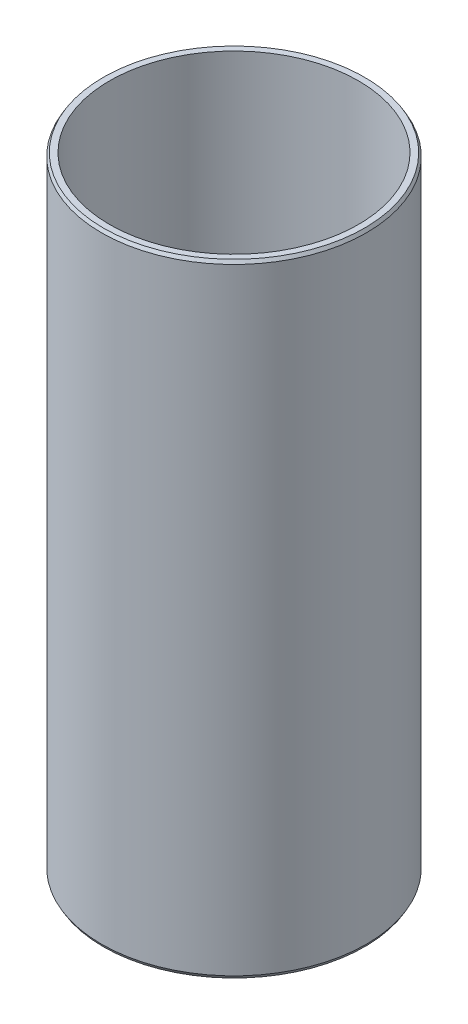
ISO-10303-21;
HEADER;
FILE_DESCRIPTION(('STEP AP214'),'2;1');
FILE_NAME('part.step','',(''),(''),'','','');
FILE_SCHEMA(('AUTOMOTIVE_DESIGN { 1 0 10303 214 1 1 1 1 }'));
ENDSEC;
DATA;
#1=APPLICATION_CONTEXT('core data for automotive mechanical design processes');
#2=APPLICATION_PROTOCOL_DEFINITION('international standard','automotive_design',2000,#1);
#3=PRODUCT_CONTEXT('',#1,'mechanical');
#4=PRODUCT('Part','Part','',(#3));
#5=PRODUCT_RELATED_PRODUCT_CATEGORY('part','',(#4));
#6=PRODUCT_DEFINITION_FORMATION('','',#4);
#7=PRODUCT_DEFINITION_CONTEXT('part definition',#1,'design');
#8=PRODUCT_DEFINITION('design','',#6,#7);
#9=PRODUCT_DEFINITION_SHAPE('','',#8);
#10=(LENGTH_UNIT() NAMED_UNIT(*) SI_UNIT(.MILLI.,.METRE.));
#11=(NAMED_UNIT(*) PLANE_ANGLE_UNIT() SI_UNIT($,.RADIAN.));
#12=(NAMED_UNIT(*) SI_UNIT($,.STERADIAN.) SOLID_ANGLE_UNIT());
#13=UNCERTAINTY_MEASURE_WITH_UNIT(LENGTH_MEASURE(1.E-05),#10,'distance_accuracy_value','');
#14=(GEOMETRIC_REPRESENTATION_CONTEXT(3) GLOBAL_UNCERTAINTY_ASSIGNED_CONTEXT((#13)) GLOBAL_UNIT_ASSIGNED_CONTEXT((#10,
#11,#12)) REPRESENTATION_CONTEXT('',''));
#15=CARTESIAN_POINT('',(0.,0.,0.));
#16=DIRECTION('',(0.,0.,1.));
#17=DIRECTION('',(1.,0.,0.));
#18=AXIS2_PLACEMENT_3D('',#15,#16,#17);
#19=CARTESIAN_POINT('',(0.,195.,0.));
#20=DIRECTION('',(0.,1.,0.));
#21=DIRECTION('',(0.,0.,1.));
#22=AXIS2_PLACEMENT_3D('',#19,#20,#21);
#23=PLANE('',#22);
#24=CARTESIAN_POINT('',(0.,195.,0.));
#25=DIRECTION('',(0.,1.,0.));
#26=DIRECTION('',(0.,0.,1.));
#27=AXIS2_PLACEMENT_3D('',#24,#25,#26);
#28=CIRCLE('',#27,40.9226497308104);
#29=CARTESIAN_POINT('',(0.,195.,40.9226497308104));
#30=VERTEX_POINT('',#29);
#31=EDGE_CURVE('E11',#30,#30,#28,.T.);
#32=ORIENTED_EDGE('',*,*,#31,.T.);
#33=EDGE_LOOP('',(#32));
#34=FACE_BOUND('',#33,.T.);
#35=CARTESIAN_POINT('',(0.,195.,0.));
#36=DIRECTION('',(0.,1.,0.));
#37=DIRECTION('',(0.,0.,1.));
#38=AXIS2_PLACEMENT_3D('',#35,#36,#37);
#39=CIRCLE('',#38,39.);
#40=CARTESIAN_POINT('',(0.,195.,39.));
#41=VERTEX_POINT('',#40);
#42=EDGE_CURVE('E53',#41,#41,#39,.T.);
#43=ORIENTED_EDGE('',*,*,#42,.F.);
#44=EDGE_LOOP('',(#43));
#45=FACE_BOUND('',#44,.T.);
#46=ADVANCED_FACE('F33',(#34,#45),#23,.T.);
#47=CARTESIAN_POINT('',(0.,0.,0.));
#48=DIRECTION('',(0.,1.,0.));
#49=DIRECTION('',(0.,0.,1.));
#50=AXIS2_PLACEMENT_3D('',#47,#48,#49);
#51=PLANE('',#50);
#52=CARTESIAN_POINT('',(0.,0.,0.));
#53=DIRECTION('',(0.,1.,0.));
#54=DIRECTION('',(0.,0.,1.));
#55=AXIS2_PLACEMENT_3D('',#52,#53,#54);
#56=CIRCLE('',#55,40.9226497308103);
#57=CARTESIAN_POINT('',(0.,0.,40.9226497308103));
#58=VERTEX_POINT('',#57);
#59=EDGE_CURVE('E40',#58,#58,#56,.F.);
#60=ORIENTED_EDGE('',*,*,#59,.T.);
#61=EDGE_LOOP('',(#60));
#62=FACE_BOUND('',#61,.T.);
#63=CARTESIAN_POINT('',(0.,0.,0.));
#64=DIRECTION('',(0.,1.,0.));
#65=DIRECTION('',(0.,0.,1.));
#66=AXIS2_PLACEMENT_3D('',#63,#64,#65);
#67=CIRCLE('',#66,39.);
#68=CARTESIAN_POINT('',(0.,0.,39.));
#69=VERTEX_POINT('',#68);
#70=EDGE_CURVE('E54',#69,#69,#67,.T.);
#71=ORIENTED_EDGE('',*,*,#70,.T.);
#72=EDGE_LOOP('',(#71));
#73=FACE_BOUND('',#72,.T.);
#74=ADVANCED_FACE('F64',(#62,#73),#51,.F.);
#75=CARTESIAN_POINT('',(0.,195.,0.));
#76=DIRECTION('',(0.,-1.,0.));
#77=DIRECTION('',(0.,0.,-1.));
#78=AXIS2_PLACEMENT_3D('',#75,#76,#77);
#79=CYLINDRICAL_SURFACE('',#78,41.5);
#80=CARTESIAN_POINT('',(0.,1.00000000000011,0.));
#81=DIRECTION('',(0.,1.,0.));
#82=DIRECTION('',(0.,0.,1.));
#83=AXIS2_PLACEMENT_3D('',#80,#81,#82);
#84=CIRCLE('',#83,41.5);
#85=CARTESIAN_POINT('',(0.,1.00000000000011,41.5));
#86=VERTEX_POINT('',#85);
#87=EDGE_CURVE('E44',#86,#86,#84,.T.);
#88=ORIENTED_EDGE('',*,*,#87,.T.);
#89=EDGE_LOOP('',(#88));
#90=FACE_BOUND('',#89,.T.);
#91=CARTESIAN_POINT('',(0.,194.,0.));
#92=DIRECTION('',(0.,1.,0.));
#93=DIRECTION('',(0.,0.,1.));
#94=AXIS2_PLACEMENT_3D('',#91,#92,#93);
#95=CIRCLE('',#94,41.5);
#96=CARTESIAN_POINT('',(0.,194.,41.5));
#97=VERTEX_POINT('',#96);
#98=EDGE_CURVE('E48',#97,#97,#95,.F.);
#99=ORIENTED_EDGE('',*,*,#98,.T.);
#100=EDGE_LOOP('',(#99));
#101=FACE_BOUND('',#100,.T.);
#102=ADVANCED_FACE('F69',(#90,#101),#79,.T.);
#103=CARTESIAN_POINT('',(0.,195.,0.));
#104=DIRECTION('',(0.,-1.,0.));
#105=DIRECTION('',(0.,0.,-1.));
#106=AXIS2_PLACEMENT_3D('',#103,#104,#105);
#107=CYLINDRICAL_SURFACE('',#106,39.);
#108=ORIENTED_EDGE('',*,*,#42,.T.);
#109=EDGE_LOOP('',(#108));
#110=FACE_BOUND('',#109,.T.);
#111=ORIENTED_EDGE('',*,*,#70,.F.);
#112=EDGE_LOOP('',(#111));
#113=FACE_BOUND('',#112,.T.);
#114=ADVANCED_FACE('F60',(#110,#113),#107,.F.);
#115=CARTESIAN_POINT('',(0.,1.00000000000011,0.));
#116=DIRECTION('',(0.,1.,0.));
#117=DIRECTION('',(0.,0.,1.));
#118=AXIS2_PLACEMENT_3D('',#115,#116,#117);
#119=CONICAL_SURFACE('',#118,41.5,0.523598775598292);
#120=ORIENTED_EDGE('',*,*,#59,.F.);
#121=EDGE_LOOP('',(#120));
#122=FACE_BOUND('',#121,.T.);
#123=ORIENTED_EDGE('',*,*,#87,.F.);
#124=EDGE_LOOP('',(#123));
#125=FACE_BOUND('',#124,.T.);
#126=ADVANCED_FACE('F75',(#122,#125),#119,.T.);
#127=CARTESIAN_POINT('',(0.,195.,0.));
#128=DIRECTION('',(0.,-1.,0.));
#129=DIRECTION('',(0.,0.,-1.));
#130=AXIS2_PLACEMENT_3D('',#127,#128,#129);
#131=CONICAL_SURFACE('',#130,40.9226497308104,0.523598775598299);
#132=ORIENTED_EDGE('',*,*,#98,.F.);
#133=EDGE_LOOP('',(#132));
#134=FACE_BOUND('',#133,.T.);
#135=ORIENTED_EDGE('',*,*,#31,.F.);
#136=EDGE_LOOP('',(#135));
#137=FACE_BOUND('',#136,.T.);
#138=ADVANCED_FACE('F35',(#134,#137),#131,.T.);
#139=CLOSED_SHELL('',(#46,#74,#102,#114,#126,#138));
#140=MANIFOLD_SOLID_BREP('B2',#139);
#141=ADVANCED_BREP_SHAPE_REPRESENTATION('',(#18,#140),#14);
#142=SHAPE_DEFINITION_REPRESENTATION(#9,#141);
ENDSEC;
END-ISO-10303-21;
